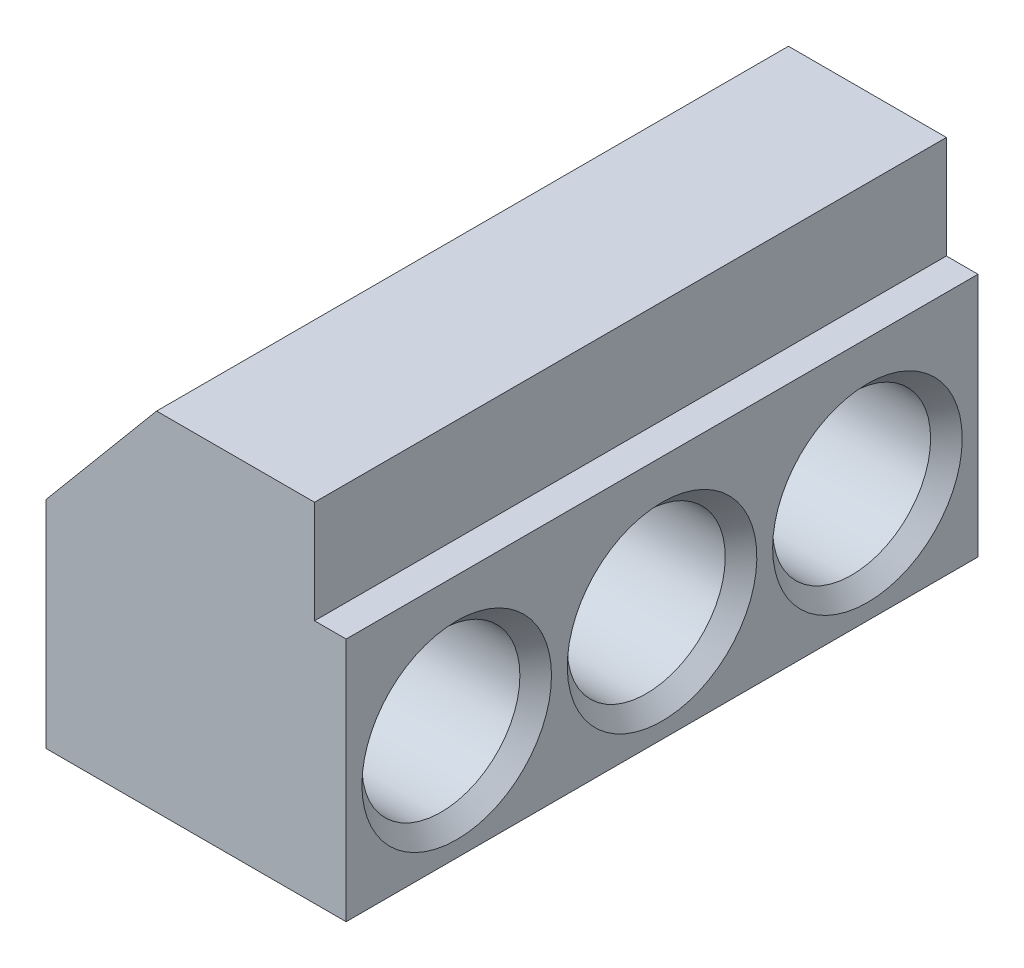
ISO-10303-21;
HEADER;
FILE_DESCRIPTION(('STEP AP214'),'2;1');
FILE_NAME('part.step','',(''),(''),'','','');
FILE_SCHEMA(('AUTOMOTIVE_DESIGN { 1 0 10303 214 1 1 1 1 }'));
ENDSEC;
DATA;
#1=APPLICATION_CONTEXT('core data for automotive mechanical design processes');
#2=APPLICATION_PROTOCOL_DEFINITION('international standard','automotive_design',2000,#1);
#3=PRODUCT_CONTEXT('',#1,'mechanical');
#4=PRODUCT('Part','Part','',(#3));
#5=PRODUCT_RELATED_PRODUCT_CATEGORY('part','',(#4));
#6=PRODUCT_DEFINITION_FORMATION('','',#4);
#7=PRODUCT_DEFINITION_CONTEXT('part definition',#1,'design');
#8=PRODUCT_DEFINITION('design','',#6,#7);
#9=PRODUCT_DEFINITION_SHAPE('','',#8);
#10=(LENGTH_UNIT() NAMED_UNIT(*) SI_UNIT(.MILLI.,.METRE.));
#11=(NAMED_UNIT(*) PLANE_ANGLE_UNIT() SI_UNIT($,.RADIAN.));
#12=(NAMED_UNIT(*) SI_UNIT($,.STERADIAN.) SOLID_ANGLE_UNIT());
#13=UNCERTAINTY_MEASURE_WITH_UNIT(LENGTH_MEASURE(1.E-05),#10,'distance_accuracy_value','');
#14=(GEOMETRIC_REPRESENTATION_CONTEXT(3) GLOBAL_UNCERTAINTY_ASSIGNED_CONTEXT((#13)) GLOBAL_UNIT_ASSIGNED_CONTEXT((#10,
#11,#12)) REPRESENTATION_CONTEXT('',''));
#15=CARTESIAN_POINT('',(0.,0.,0.));
#16=DIRECTION('',(0.,0.,1.));
#17=DIRECTION('',(1.,0.,0.));
#18=AXIS2_PLACEMENT_3D('',#15,#16,#17);
#19=CARTESIAN_POINT('',(0.,0.,-40.));
#20=DIRECTION('',(-1.,0.,0.));
#21=DIRECTION('',(0.,0.,1.));
#22=AXIS2_PLACEMENT_3D('',#19,#20,#21);
#23=PLANE('',#22);
#24=CARTESIAN_POINT('',(0.,7.,-20.));
#25=DIRECTION('',(-1.,0.,0.));
#26=DIRECTION('',(0.,0.,1.));
#27=AXIS2_PLACEMENT_3D('',#24,#25,#26);
#28=CIRCLE('',#27,3.5);
#29=CARTESIAN_POINT('',(0.,7.,-16.5));
#30=VERTEX_POINT('',#29);
#31=EDGE_CURVE('E56',#30,#30,#28,.F.);
#32=ORIENTED_EDGE('',*,*,#31,.T.);
#33=EDGE_LOOP('',(#32));
#34=FACE_BOUND('',#33,.T.);
#35=CARTESIAN_POINT('',(0.,7.,-33.));
#36=DIRECTION('',(-1.,0.,0.));
#37=DIRECTION('',(0.,0.,1.));
#38=AXIS2_PLACEMENT_3D('',#35,#36,#37);
#39=CIRCLE('',#38,5.99999999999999);
#40=CARTESIAN_POINT('',(0.,7.,-27.));
#41=VERTEX_POINT('',#40);
#42=EDGE_CURVE('E182',#41,#41,#39,.F.);
#43=ORIENTED_EDGE('',*,*,#42,.T.);
#44=EDGE_LOOP('',(#43));
#45=FACE_BOUND('',#44,.T.);
#46=CARTESIAN_POINT('',(0.,7.,-7.));
#47=DIRECTION('',(-1.,0.,0.));
#48=DIRECTION('',(0.,0.,1.));
#49=AXIS2_PLACEMENT_3D('',#46,#47,#48);
#50=CIRCLE('',#49,6.);
#51=CARTESIAN_POINT('',(0.,7.,-0.999999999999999));
#52=VERTEX_POINT('',#51);
#53=EDGE_CURVE('E179',#52,#52,#50,.F.);
#54=ORIENTED_EDGE('',*,*,#53,.T.);
#55=EDGE_LOOP('',(#54));
#56=FACE_BOUND('',#55,.T.);
#57=DIRECTION('',(0.,-1.,0.));
#58=VECTOR('',#57,1.);
#59=CARTESIAN_POINT('',(0.,0.,0.));
#60=LINE('',#59,#58);
#61=CARTESIAN_POINT('',(0.,13.65,0.));
#62=VERTEX_POINT('',#61);
#63=CARTESIAN_POINT('',(0.,0.,0.));
#64=VERTEX_POINT('',#63);
#65=EDGE_CURVE('E136',#62,#64,#60,.T.);
#66=ORIENTED_EDGE('',*,*,#65,.F.);
#67=DIRECTION('',(0.,0.,1.));
#68=VECTOR('',#67,1.);
#69=CARTESIAN_POINT('',(0.,13.65,-40.));
#70=LINE('',#69,#68);
#71=CARTESIAN_POINT('',(0.,13.65,-40.));
#72=VERTEX_POINT('',#71);
#73=EDGE_CURVE('E71',#72,#62,#70,.T.);
#74=ORIENTED_EDGE('',*,*,#73,.F.);
#75=DIRECTION('',(0.,-1.,0.));
#76=VECTOR('',#75,1.);
#77=CARTESIAN_POINT('',(0.,0.,-40.));
#78=LINE('',#77,#76);
#79=CARTESIAN_POINT('',(0.,0.,-40.));
#80=VERTEX_POINT('',#79);
#81=EDGE_CURVE('E142',#72,#80,#78,.T.);
#82=ORIENTED_EDGE('',*,*,#81,.T.);
#83=DIRECTION('',(0.,0.,1.));
#84=VECTOR('',#83,1.);
#85=CARTESIAN_POINT('',(0.,0.,-40.));
#86=LINE('',#85,#84);
#87=EDGE_CURVE('E153',#80,#64,#86,.T.);
#88=ORIENTED_EDGE('',*,*,#87,.T.);
#89=EDGE_LOOP('',(#66,#74,#82,#88));
#90=FACE_BOUND('',#89,.T.);
#91=ADVANCED_FACE('F49',(#34,#45,#56,#90),#23,.T.);
#92=CARTESIAN_POINT('',(7.,22.,-40.));
#93=DIRECTION('',(-0.766337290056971,0.642438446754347,0.));
#94=DIRECTION('',(-0.642438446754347,-0.766337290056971,0.));
#95=AXIS2_PLACEMENT_3D('',#92,#93,#94);
#96=PLANE('',#95);
#97=DIRECTION('',(-0.642438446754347,-0.766337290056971,0.));
#98=VECTOR('',#97,1.);
#99=CARTESIAN_POINT('',(7.,22.,0.));
#100=LINE('',#99,#98);
#101=CARTESIAN_POINT('',(7.,22.,0.));
#102=VERTEX_POINT('',#101);
#103=EDGE_CURVE('E134',#102,#62,#100,.T.);
#104=ORIENTED_EDGE('',*,*,#103,.F.);
#105=DIRECTION('',(0.,0.,1.));
#106=VECTOR('',#105,1.);
#107=CARTESIAN_POINT('',(7.,22.,-40.));
#108=LINE('',#107,#106);
#109=CARTESIAN_POINT('',(7.,22.,-40.));
#110=VERTEX_POINT('',#109);
#111=EDGE_CURVE('E156',#110,#102,#108,.T.);
#112=ORIENTED_EDGE('',*,*,#111,.F.);
#113=DIRECTION('',(-0.642438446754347,-0.766337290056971,0.));
#114=VECTOR('',#113,1.);
#115=CARTESIAN_POINT('',(7.,22.,-40.));
#116=LINE('',#115,#114);
#117=EDGE_CURVE('E150',#110,#72,#116,.T.);
#118=ORIENTED_EDGE('',*,*,#117,.T.);
#119=ORIENTED_EDGE('',*,*,#73,.T.);
#120=EDGE_LOOP('',(#104,#112,#118,#119));
#121=FACE_BOUND('',#120,.T.);
#122=ADVANCED_FACE('F208',(#121),#96,.T.);
#123=CARTESIAN_POINT('',(7.,22.,-40.));
#124=DIRECTION('',(0.,1.,0.));
#125=DIRECTION('',(0.,0.,1.));
#126=AXIS2_PLACEMENT_3D('',#123,#124,#125);
#127=PLANE('',#126);
#128=DIRECTION('',(0.,0.,1.));
#129=VECTOR('',#128,1.);
#130=CARTESIAN_POINT('',(17.,22.,-40.));
#131=LINE('',#130,#129);
#132=CARTESIAN_POINT('',(17.,22.,-40.));
#133=VERTEX_POINT('',#132);
#134=CARTESIAN_POINT('',(17.,22.,0.));
#135=VERTEX_POINT('',#134);
#136=EDGE_CURVE('E126',#133,#135,#131,.T.);
#137=ORIENTED_EDGE('',*,*,#136,.F.);
#138=DIRECTION('',(-1.,0.,0.));
#139=VECTOR('',#138,1.);
#140=CARTESIAN_POINT('',(7.,22.,-40.));
#141=LINE('',#140,#139);
#142=EDGE_CURVE('E148',#133,#110,#141,.T.);
#143=ORIENTED_EDGE('',*,*,#142,.T.);
#144=ORIENTED_EDGE('',*,*,#111,.T.);
#145=DIRECTION('',(-1.,0.,0.));
#146=VECTOR('',#145,1.);
#147=CARTESIAN_POINT('',(7.,22.,0.));
#148=LINE('',#147,#146);
#149=EDGE_CURVE('E132',#135,#102,#148,.T.);
#150=ORIENTED_EDGE('',*,*,#149,.F.);
#151=EDGE_LOOP('',(#137,#143,#144,#150));
#152=FACE_BOUND('',#151,.T.);
#153=ADVANCED_FACE('F212',(#152),#127,.T.);
#154=CARTESIAN_POINT('',(19.,0.,-40.));
#155=DIRECTION('',(1.,0.,0.));
#156=DIRECTION('',(0.,1.,0.));
#157=AXIS2_PLACEMENT_3D('',#154,#155,#156);
#158=PLANE('',#157);
#159=CARTESIAN_POINT('',(19.,7.,-20.));
#160=DIRECTION('',(1.,0.,0.));
#161=DIRECTION('',(0.,1.,0.));
#162=AXIS2_PLACEMENT_3D('',#159,#160,#161);
#163=CIRCLE('',#162,6.);
#164=CARTESIAN_POINT('',(19.,13.,-20.));
#165=VERTEX_POINT('',#164);
#166=EDGE_CURVE('E188',#165,#165,#163,.F.);
#167=ORIENTED_EDGE('',*,*,#166,.T.);
#168=EDGE_LOOP('',(#167));
#169=FACE_BOUND('',#168,.T.);
#170=CARTESIAN_POINT('',(19.,7.,-7.));
#171=DIRECTION('',(1.,0.,0.));
#172=DIRECTION('',(0.,1.,0.));
#173=AXIS2_PLACEMENT_3D('',#170,#171,#172);
#174=CIRCLE('',#173,6.);
#175=CARTESIAN_POINT('',(19.,13.,-7.));
#176=VERTEX_POINT('',#175);
#177=EDGE_CURVE('E170',#176,#176,#174,.F.);
#178=ORIENTED_EDGE('',*,*,#177,.T.);
#179=EDGE_LOOP('',(#178));
#180=FACE_BOUND('',#179,.T.);
#181=CARTESIAN_POINT('',(19.,7.,-33.));
#182=DIRECTION('',(1.,0.,0.));
#183=DIRECTION('',(0.,1.,0.));
#184=AXIS2_PLACEMENT_3D('',#181,#182,#183);
#185=CIRCLE('',#184,6.);
#186=CARTESIAN_POINT('',(19.,13.,-33.));
#187=VERTEX_POINT('',#186);
#188=EDGE_CURVE('E167',#187,#187,#185,.F.);
#189=ORIENTED_EDGE('',*,*,#188,.T.);
#190=EDGE_LOOP('',(#189));
#191=FACE_BOUND('',#190,.T.);
#192=DIRECTION('',(0.,0.,1.));
#193=VECTOR('',#192,1.);
#194=CARTESIAN_POINT('',(19.,15.5,-40.));
#195=LINE('',#194,#193);
#196=CARTESIAN_POINT('',(19.,15.5,-40.));
#197=VERTEX_POINT('',#196);
#198=CARTESIAN_POINT('',(19.,15.5,0.));
#199=VERTEX_POINT('',#198);
#200=EDGE_CURVE('E111',#197,#199,#195,.T.);
#201=ORIENTED_EDGE('',*,*,#200,.T.);
#202=DIRECTION('',(0.,1.,0.));
#203=VECTOR('',#202,1.);
#204=CARTESIAN_POINT('',(19.,0.,0.));
#205=LINE('',#204,#203);
#206=CARTESIAN_POINT('',(19.,0.,0.));
#207=VERTEX_POINT('',#206);
#208=EDGE_CURVE('E122',#207,#199,#205,.T.);
#209=ORIENTED_EDGE('',*,*,#208,.F.);
#210=DIRECTION('',(0.,0.,1.));
#211=VECTOR('',#210,1.);
#212=CARTESIAN_POINT('',(19.,0.,-40.));
#213=LINE('',#212,#211);
#214=CARTESIAN_POINT('',(19.,0.,-40.));
#215=VERTEX_POINT('',#214);
#216=EDGE_CURVE('E159',#215,#207,#213,.T.);
#217=ORIENTED_EDGE('',*,*,#216,.F.);
#218=DIRECTION('',(0.,1.,0.));
#219=VECTOR('',#218,1.);
#220=CARTESIAN_POINT('',(19.,0.,-40.));
#221=LINE('',#220,#219);
#222=EDGE_CURVE('E125',#215,#197,#221,.T.);
#223=ORIENTED_EDGE('',*,*,#222,.T.);
#224=EDGE_LOOP('',(#201,#209,#217,#223));
#225=FACE_BOUND('',#224,.T.);
#226=ADVANCED_FACE('F121',(#169,#180,#191,#225),#158,.T.);
#227=CARTESIAN_POINT('',(0.,0.,-40.));
#228=DIRECTION('',(0.,-1.,0.));
#229=DIRECTION('',(0.,0.,-1.));
#230=AXIS2_PLACEMENT_3D('',#227,#228,#229);
#231=PLANE('',#230);
#232=DIRECTION('',(1.,0.,0.));
#233=VECTOR('',#232,1.);
#234=CARTESIAN_POINT('',(0.,0.,0.));
#235=LINE('',#234,#233);
#236=EDGE_CURVE('E131',#64,#207,#235,.T.);
#237=ORIENTED_EDGE('',*,*,#236,.F.);
#238=ORIENTED_EDGE('',*,*,#87,.F.);
#239=DIRECTION('',(1.,0.,0.));
#240=VECTOR('',#239,1.);
#241=CARTESIAN_POINT('',(0.,0.,-40.));
#242=LINE('',#241,#240);
#243=EDGE_CURVE('E144',#80,#215,#242,.T.);
#244=ORIENTED_EDGE('',*,*,#243,.T.);
#245=ORIENTED_EDGE('',*,*,#216,.T.);
#246=EDGE_LOOP('',(#237,#238,#244,#245));
#247=FACE_BOUND('',#246,.T.);
#248=ADVANCED_FACE('F226',(#247),#231,.T.);
#249=CARTESIAN_POINT('',(0.,22.,-40.));
#250=DIRECTION('',(0.,0.,-1.));
#251=DIRECTION('',(-1.,0.,0.));
#252=AXIS2_PLACEMENT_3D('',#249,#250,#251);
#253=PLANE('',#252);
#254=DIRECTION('',(0.,-1.,0.));
#255=VECTOR('',#254,1.);
#256=CARTESIAN_POINT('',(17.,22.,-40.));
#257=LINE('',#256,#255);
#258=CARTESIAN_POINT('',(17.,15.5,-40.));
#259=VERTEX_POINT('',#258);
#260=EDGE_CURVE('E116',#133,#259,#257,.T.);
#261=ORIENTED_EDGE('',*,*,#260,.T.);
#262=DIRECTION('',(1.,0.,0.));
#263=VECTOR('',#262,1.);
#264=CARTESIAN_POINT('',(17.,15.5,-40.));
#265=LINE('',#264,#263);
#266=EDGE_CURVE('E237',#259,#197,#265,.T.);
#267=ORIENTED_EDGE('',*,*,#266,.T.);
#268=ORIENTED_EDGE('',*,*,#222,.F.);
#269=ORIENTED_EDGE('',*,*,#243,.F.);
#270=ORIENTED_EDGE('',*,*,#81,.F.);
#271=ORIENTED_EDGE('',*,*,#117,.F.);
#272=ORIENTED_EDGE('',*,*,#142,.F.);
#273=EDGE_LOOP('',(#261,#267,#268,#269,#270,#271,#272));
#274=FACE_BOUND('',#273,.T.);
#275=ADVANCED_FACE('F222',(#274),#253,.T.);
#276=CARTESIAN_POINT('',(0.,22.,0.));
#277=DIRECTION('',(0.,0.,-1.));
#278=DIRECTION('',(-1.,0.,0.));
#279=AXIS2_PLACEMENT_3D('',#276,#277,#278);
#280=PLANE('',#279);
#281=DIRECTION('',(1.,0.,0.));
#282=VECTOR('',#281,1.);
#283=CARTESIAN_POINT('',(17.,15.5,0.));
#284=LINE('',#283,#282);
#285=CARTESIAN_POINT('',(17.,15.5,0.));
#286=VERTEX_POINT('',#285);
#287=EDGE_CURVE('E107',#286,#199,#284,.T.);
#288=ORIENTED_EDGE('',*,*,#287,.F.);
#289=DIRECTION('',(0.,-1.,0.));
#290=VECTOR('',#289,1.);
#291=CARTESIAN_POINT('',(17.,22.,0.));
#292=LINE('',#291,#290);
#293=EDGE_CURVE('E63',#135,#286,#292,.T.);
#294=ORIENTED_EDGE('',*,*,#293,.F.);
#295=ORIENTED_EDGE('',*,*,#149,.T.);
#296=ORIENTED_EDGE('',*,*,#103,.T.);
#297=ORIENTED_EDGE('',*,*,#65,.T.);
#298=ORIENTED_EDGE('',*,*,#236,.T.);
#299=ORIENTED_EDGE('',*,*,#208,.T.);
#300=EDGE_LOOP('',(#288,#294,#295,#296,#297,#298,#299));
#301=FACE_BOUND('',#300,.T.);
#302=ADVANCED_FACE('F128',(#301),#280,.F.);
#303=CARTESIAN_POINT('',(17.,22.,-40.));
#304=DIRECTION('',(-1.,0.,0.));
#305=DIRECTION('',(0.,-1.,0.));
#306=AXIS2_PLACEMENT_3D('',#303,#304,#305);
#307=PLANE('',#306);
#308=ORIENTED_EDGE('',*,*,#293,.T.);
#309=DIRECTION('',(0.,0.,1.));
#310=VECTOR('',#309,1.);
#311=CARTESIAN_POINT('',(17.,15.5,-40.));
#312=LINE('',#311,#310);
#313=EDGE_CURVE('E113',#259,#286,#312,.T.);
#314=ORIENTED_EDGE('',*,*,#313,.F.);
#315=ORIENTED_EDGE('',*,*,#260,.F.);
#316=ORIENTED_EDGE('',*,*,#136,.T.);
#317=EDGE_LOOP('',(#308,#314,#315,#316));
#318=FACE_BOUND('',#317,.T.);
#319=ADVANCED_FACE('F291',(#318),#307,.F.);
#320=CARTESIAN_POINT('',(17.,15.5,-40.));
#321=DIRECTION('',(0.,-1.,0.));
#322=DIRECTION('',(0.,0.,-1.));
#323=AXIS2_PLACEMENT_3D('',#320,#321,#322);
#324=PLANE('',#323);
#325=ORIENTED_EDGE('',*,*,#287,.T.);
#326=ORIENTED_EDGE('',*,*,#200,.F.);
#327=ORIENTED_EDGE('',*,*,#266,.F.);
#328=ORIENTED_EDGE('',*,*,#313,.T.);
#329=EDGE_LOOP('',(#325,#326,#327,#328));
#330=FACE_BOUND('',#329,.T.);
#331=ADVANCED_FACE('F109',(#330),#324,.F.);
#332=CARTESIAN_POINT('',(0.,7.,-7.));
#333=DIRECTION('',(1.,0.,0.));
#334=DIRECTION('',(0.,1.,0.));
#335=AXIS2_PLACEMENT_3D('',#332,#333,#334);
#336=CYLINDRICAL_SURFACE('',#335,5.);
#337=CARTESIAN_POINT('',(18.,7.,-7.));
#338=DIRECTION('',(1.,0.,0.));
#339=DIRECTION('',(0.,0.,-1.));
#340=AXIS2_PLACEMENT_3D('',#337,#338,#339);
#341=CIRCLE('',#340,5.);
#342=CARTESIAN_POINT('',(18.,7.,-12.));
#343=VERTEX_POINT('',#342);
#344=EDGE_CURVE('E164',#343,#343,#341,.T.);
#345=ORIENTED_EDGE('',*,*,#344,.T.);
#346=EDGE_LOOP('',(#345));
#347=FACE_BOUND('',#346,.T.);
#348=CARTESIAN_POINT('',(1.,7.,-7.));
#349=DIRECTION('',(-1.,0.,0.));
#350=DIRECTION('',(0.,0.,1.));
#351=AXIS2_PLACEMENT_3D('',#348,#349,#350);
#352=CIRCLE('',#351,5.);
#353=CARTESIAN_POINT('',(1.,7.,-2.));
#354=VERTEX_POINT('',#353);
#355=EDGE_CURVE('E155',#354,#354,#352,.T.);
#356=ORIENTED_EDGE('',*,*,#355,.T.);
#357=EDGE_LOOP('',(#356));
#358=FACE_BOUND('',#357,.T.);
#359=ADVANCED_FACE('F284',(#347,#358),#336,.F.);
#360=CARTESIAN_POINT('',(0.,7.,-33.));
#361=DIRECTION('',(1.,0.,0.));
#362=DIRECTION('',(0.,1.,0.));
#363=AXIS2_PLACEMENT_3D('',#360,#361,#362);
#364=CYLINDRICAL_SURFACE('',#363,5.);
#365=CARTESIAN_POINT('',(18.,7.,-33.));
#366=DIRECTION('',(1.,0.,0.));
#367=DIRECTION('',(0.,0.,-1.));
#368=AXIS2_PLACEMENT_3D('',#365,#366,#367);
#369=CIRCLE('',#368,5.);
#370=CARTESIAN_POINT('',(18.,7.,-38.));
#371=VERTEX_POINT('',#370);
#372=EDGE_CURVE('E176',#371,#371,#369,.T.);
#373=ORIENTED_EDGE('',*,*,#372,.T.);
#374=EDGE_LOOP('',(#373));
#375=FACE_BOUND('',#374,.T.);
#376=CARTESIAN_POINT('',(1.,7.,-33.));
#377=DIRECTION('',(-1.,0.,0.));
#378=DIRECTION('',(0.,0.,1.));
#379=AXIS2_PLACEMENT_3D('',#376,#377,#378);
#380=CIRCLE('',#379,5.);
#381=CARTESIAN_POINT('',(1.,7.,-28.));
#382=VERTEX_POINT('',#381);
#383=EDGE_CURVE('E173',#382,#382,#380,.T.);
#384=ORIENTED_EDGE('',*,*,#383,.T.);
#385=EDGE_LOOP('',(#384));
#386=FACE_BOUND('',#385,.T.);
#387=ADVANCED_FACE('F280',(#375,#386),#364,.F.);
#388=CARTESIAN_POINT('',(18.,7.,-7.));
#389=DIRECTION('',(1.,0.,0.));
#390=DIRECTION('',(0.,0.,-1.));
#391=AXIS2_PLACEMENT_3D('',#388,#389,#390);
#392=CONICAL_SURFACE('',#391,5.,0.785398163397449);
#393=ORIENTED_EDGE('',*,*,#177,.F.);
#394=EDGE_LOOP('',(#393));
#395=FACE_BOUND('',#394,.T.);
#396=ORIENTED_EDGE('',*,*,#344,.F.);
#397=EDGE_LOOP('',(#396));
#398=FACE_BOUND('',#397,.T.);
#399=ADVANCED_FACE('F276',(#395,#398),#392,.F.);
#400=CARTESIAN_POINT('',(18.,7.,-33.));
#401=DIRECTION('',(1.,0.,0.));
#402=DIRECTION('',(0.,0.,-1.));
#403=AXIS2_PLACEMENT_3D('',#400,#401,#402);
#404=CONICAL_SURFACE('',#403,5.,0.78539816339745);
#405=ORIENTED_EDGE('',*,*,#188,.F.);
#406=EDGE_LOOP('',(#405));
#407=FACE_BOUND('',#406,.T.);
#408=ORIENTED_EDGE('',*,*,#372,.F.);
#409=EDGE_LOOP('',(#408));
#410=FACE_BOUND('',#409,.T.);
#411=ADVANCED_FACE('F272',(#407,#410),#404,.F.);
#412=CARTESIAN_POINT('',(0.,7.,-33.));
#413=DIRECTION('',(-1.,0.,0.));
#414=DIRECTION('',(0.,0.,1.));
#415=AXIS2_PLACEMENT_3D('',#412,#413,#414);
#416=CONICAL_SURFACE('',#415,5.99999999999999,0.785398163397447);
#417=ORIENTED_EDGE('',*,*,#383,.F.);
#418=EDGE_LOOP('',(#417));
#419=FACE_BOUND('',#418,.T.);
#420=ORIENTED_EDGE('',*,*,#42,.F.);
#421=EDGE_LOOP('',(#420));
#422=FACE_BOUND('',#421,.T.);
#423=ADVANCED_FACE('F265',(#419,#422),#416,.F.);
#424=CARTESIAN_POINT('',(0.,7.,-7.));
#425=DIRECTION('',(-1.,0.,0.));
#426=DIRECTION('',(0.,0.,1.));
#427=AXIS2_PLACEMENT_3D('',#424,#425,#426);
#428=CONICAL_SURFACE('',#427,6.,0.785398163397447);
#429=ORIENTED_EDGE('',*,*,#355,.F.);
#430=EDGE_LOOP('',(#429));
#431=FACE_BOUND('',#430,.T.);
#432=ORIENTED_EDGE('',*,*,#53,.F.);
#433=EDGE_LOOP('',(#432));
#434=FACE_BOUND('',#433,.T.);
#435=ADVANCED_FACE('F259',(#431,#434),#428,.F.);
#436=CARTESIAN_POINT('',(9.,7.,-20.));
#437=DIRECTION('',(1.,0.,0.));
#438=DIRECTION('',(0.,1.,0.));
#439=AXIS2_PLACEMENT_3D('',#436,#437,#438);
#440=CYLINDRICAL_SURFACE('',#439,5.);
#441=CARTESIAN_POINT('',(18.,7.,-20.));
#442=DIRECTION('',(1.,0.,0.));
#443=DIRECTION('',(0.,0.,-1.));
#444=AXIS2_PLACEMENT_3D('',#441,#442,#443);
#445=CIRCLE('',#444,5.);
#446=CARTESIAN_POINT('',(18.,7.,-25.));
#447=VERTEX_POINT('',#446);
#448=EDGE_CURVE('E185',#447,#447,#445,.T.);
#449=ORIENTED_EDGE('',*,*,#448,.T.);
#450=EDGE_LOOP('',(#449));
#451=FACE_BOUND('',#450,.T.);
#452=CARTESIAN_POINT('',(9.,7.,-20.));
#453=DIRECTION('',(1.,0.,0.));
#454=DIRECTION('',(0.,1.,0.));
#455=AXIS2_PLACEMENT_3D('',#452,#453,#454);
#456=CIRCLE('',#455,5.);
#457=CARTESIAN_POINT('',(9.,12.,-20.));
#458=VERTEX_POINT('',#457);
#459=EDGE_CURVE('E243',#458,#458,#456,.T.);
#460=ORIENTED_EDGE('',*,*,#459,.F.);
#461=EDGE_LOOP('',(#460));
#462=FACE_BOUND('',#461,.T.);
#463=ADVANCED_FACE('F254',(#451,#462),#440,.F.);
#464=CARTESIAN_POINT('',(9.,7.,-20.));
#465=DIRECTION('',(1.,0.,0.));
#466=DIRECTION('',(0.,1.,0.));
#467=AXIS2_PLACEMENT_3D('',#464,#465,#466);
#468=PLANE('',#467);
#469=CARTESIAN_POINT('',(9.,7.,-20.));
#470=DIRECTION('',(1.,0.,0.));
#471=DIRECTION('',(0.,1.,0.));
#472=AXIS2_PLACEMENT_3D('',#469,#470,#471);
#473=CIRCLE('',#472,3.);
#474=CARTESIAN_POINT('',(9.,9.99999999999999,-20.));
#475=VERTEX_POINT('',#474);
#476=EDGE_CURVE('E246',#475,#475,#473,.T.);
#477=ORIENTED_EDGE('',*,*,#476,.F.);
#478=EDGE_LOOP('',(#477));
#479=FACE_BOUND('',#478,.T.);
#480=ORIENTED_EDGE('',*,*,#459,.T.);
#481=EDGE_LOOP('',(#480));
#482=FACE_BOUND('',#481,.T.);
#483=ADVANCED_FACE('F251',(#479,#482),#468,.T.);
#484=CARTESIAN_POINT('',(0.,7.,-20.));
#485=DIRECTION('',(1.,0.,0.));
#486=DIRECTION('',(0.,1.,0.));
#487=AXIS2_PLACEMENT_3D('',#484,#485,#486);
#488=CYLINDRICAL_SURFACE('',#487,3.);
#489=CARTESIAN_POINT('',(0.5,7.,-20.));
#490=DIRECTION('',(-1.,0.,0.));
#491=DIRECTION('',(0.,0.,1.));
#492=AXIS2_PLACEMENT_3D('',#489,#490,#491);
#493=CIRCLE('',#492,3.);
#494=CARTESIAN_POINT('',(0.5,7.,-17.));
#495=VERTEX_POINT('',#494);
#496=EDGE_CURVE('E13',#495,#495,#493,.T.);
#497=ORIENTED_EDGE('',*,*,#496,.T.);
#498=EDGE_LOOP('',(#497));
#499=FACE_BOUND('',#498,.T.);
#500=ORIENTED_EDGE('',*,*,#476,.T.);
#501=EDGE_LOOP('',(#500));
#502=FACE_BOUND('',#501,.T.);
#503=ADVANCED_FACE('F203',(#499,#502),#488,.F.);
#504=CARTESIAN_POINT('',(18.,7.,-20.));
#505=DIRECTION('',(1.,0.,0.));
#506=DIRECTION('',(0.,0.,-1.));
#507=AXIS2_PLACEMENT_3D('',#504,#505,#506);
#508=CONICAL_SURFACE('',#507,5.,0.78539816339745);
#509=ORIENTED_EDGE('',*,*,#166,.F.);
#510=EDGE_LOOP('',(#509));
#511=FACE_BOUND('',#510,.T.);
#512=ORIENTED_EDGE('',*,*,#448,.F.);
#513=EDGE_LOOP('',(#512));
#514=FACE_BOUND('',#513,.T.);
#515=ADVANCED_FACE('F197',(#511,#514),#508,.F.);
#516=CARTESIAN_POINT('',(0.,7.,-20.));
#517=DIRECTION('',(-1.,0.,0.));
#518=DIRECTION('',(0.,0.,1.));
#519=AXIS2_PLACEMENT_3D('',#516,#517,#518);
#520=CONICAL_SURFACE('',#519,3.5,0.785398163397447);
#521=ORIENTED_EDGE('',*,*,#496,.F.);
#522=EDGE_LOOP('',(#521));
#523=FACE_BOUND('',#522,.T.);
#524=ORIENTED_EDGE('',*,*,#31,.F.);
#525=EDGE_LOOP('',(#524));
#526=FACE_BOUND('',#525,.T.);
#527=ADVANCED_FACE('F195',(#523,#526),#520,.F.);
#528=CLOSED_SHELL('',(#91,#122,#153,#226,#248,#275,#302,#319,#331,#359,#387,#399,#411,#423,#435,
#463,#483,#503,#515,#527));
#529=MANIFOLD_SOLID_BREP('B2',#528);
#530=ADVANCED_BREP_SHAPE_REPRESENTATION('',(#18,#529),#14);
#531=SHAPE_DEFINITION_REPRESENTATION(#9,#530);
ENDSEC;
END-ISO-10303-21;
